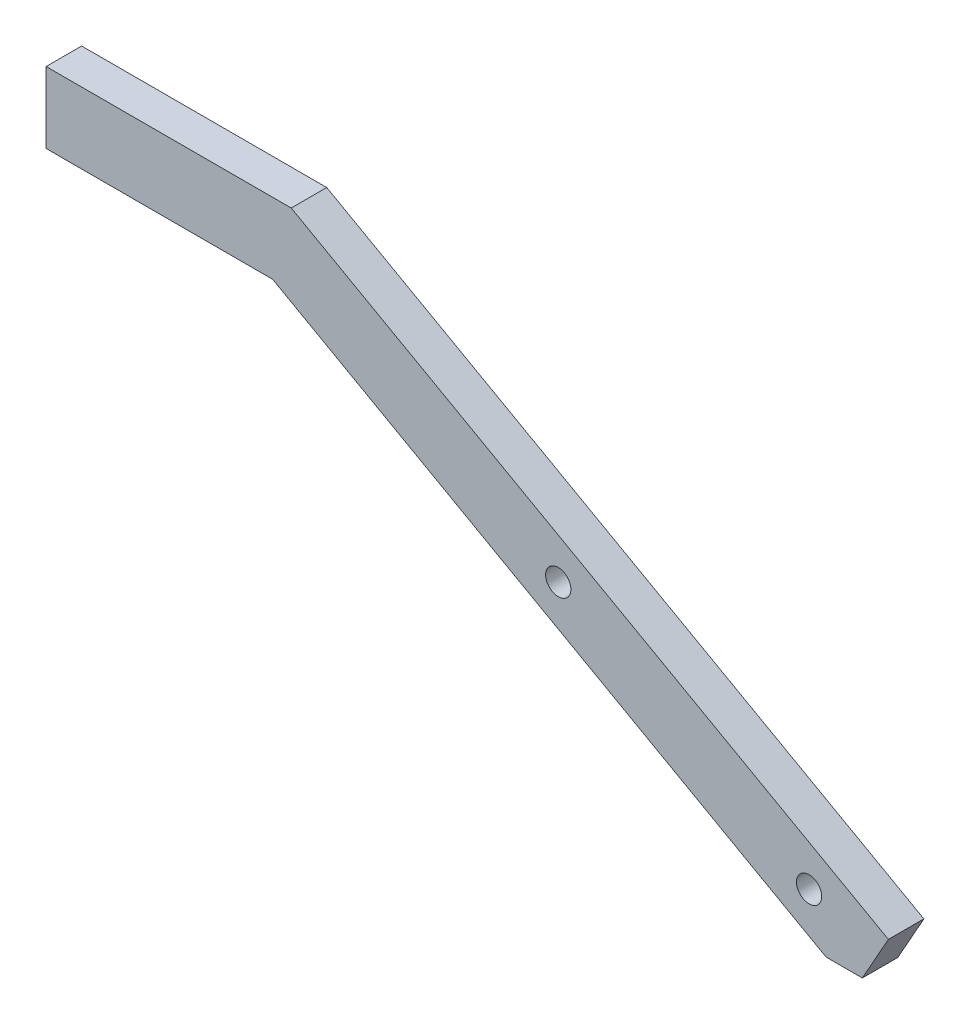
ISO-10303-21;
HEADER;
FILE_DESCRIPTION(('STEP AP214'),'2;1');
FILE_NAME('part.step','',(''),(''),'','','');
FILE_SCHEMA(('AUTOMOTIVE_DESIGN { 1 0 10303 214 1 1 1 1 }'));
ENDSEC;
DATA;
#1=APPLICATION_CONTEXT('core data for automotive mechanical design processes');
#2=APPLICATION_PROTOCOL_DEFINITION('international standard','automotive_design',2000,#1);
#3=PRODUCT_CONTEXT('',#1,'mechanical');
#4=PRODUCT('Part','Part','',(#3));
#5=PRODUCT_RELATED_PRODUCT_CATEGORY('part','',(#4));
#6=PRODUCT_DEFINITION_FORMATION('','',#4);
#7=PRODUCT_DEFINITION_CONTEXT('part definition',#1,'design');
#8=PRODUCT_DEFINITION('design','',#6,#7);
#9=PRODUCT_DEFINITION_SHAPE('','',#8);
#10=(LENGTH_UNIT() NAMED_UNIT(*) SI_UNIT(.MILLI.,.METRE.));
#11=(NAMED_UNIT(*) PLANE_ANGLE_UNIT() SI_UNIT($,.RADIAN.));
#12=(NAMED_UNIT(*) SI_UNIT($,.STERADIAN.) SOLID_ANGLE_UNIT());
#13=UNCERTAINTY_MEASURE_WITH_UNIT(LENGTH_MEASURE(1.E-05),#10,'distance_accuracy_value','');
#14=(GEOMETRIC_REPRESENTATION_CONTEXT(3) GLOBAL_UNCERTAINTY_ASSIGNED_CONTEXT((#13)) GLOBAL_UNIT_ASSIGNED_CONTEXT((#10,
#11,#12)) REPRESENTATION_CONTEXT('',''));
#15=CARTESIAN_POINT('',(0.,0.,0.));
#16=DIRECTION('',(0.,0.,1.));
#17=DIRECTION('',(1.,0.,0.));
#18=AXIS2_PLACEMENT_3D('',#15,#16,#17);
#19=CARTESIAN_POINT('',(-88.2195748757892,-59.4901280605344,0.));
#20=DIRECTION('',(0.,0.,1.));
#21=DIRECTION('',(1.,0.,0.));
#22=AXIS2_PLACEMENT_3D('',#19,#20,#21);
#23=PLANE('',#22);
#24=CARTESIAN_POINT('',(-20.,-55.,0.));
#25=DIRECTION('',(0.,0.,-1.));
#26=DIRECTION('',(-1.,0.,0.));
#27=AXIS2_PLACEMENT_3D('',#24,#25,#26);
#28=CIRCLE('',#27,1.13029999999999);
#29=CARTESIAN_POINT('',(-21.1303,-55.,0.));
#30=VERTEX_POINT('',#29);
#31=EDGE_CURVE('E201',#30,#30,#28,.T.);
#32=ORIENTED_EDGE('',*,*,#31,.F.);
#33=EDGE_LOOP('',(#32));
#34=FACE_BOUND('',#33,.T.);
#35=DIRECTION('',(1.,0.,0.));
#36=VECTOR('',#35,1.);
#37=CARTESIAN_POINT('',(-15.2375,-59.4901280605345,0.));
#38=LINE('',#37,#36);
#39=CARTESIAN_POINT('',(-18.4836446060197,-59.4901280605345,0.));
#40=VERTEX_POINT('',#39);
#41=CARTESIAN_POINT('',(-15.2375,-59.4901280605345,0.));
#42=VERTEX_POINT('',#41);
#43=EDGE_CURVE('E98',#40,#42,#38,.T.);
#44=ORIENTED_EDGE('',*,*,#43,.F.);
#45=DIRECTION('',(0.872260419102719,-0.489041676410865,0.));
#46=VECTOR('',#45,1.);
#47=CARTESIAN_POINT('',(-18.4836446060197,-59.4901280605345,0.));
#48=LINE('',#47,#46);
#49=CARTESIAN_POINT('',(-67.9612594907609,-31.75,0.));
#50=VERTEX_POINT('',#49);
#51=EDGE_CURVE('E126',#50,#40,#48,.T.);
#52=ORIENTED_EDGE('',*,*,#51,.F.);
#53=DIRECTION('',(1.,0.,0.));
#54=VECTOR('',#53,1.);
#55=CARTESIAN_POINT('',(-67.9612594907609,-31.75,0.));
#56=LINE('',#55,#54);
#57=CARTESIAN_POINT('',(-88.2195748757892,-31.75,0.));
#58=VERTEX_POINT('',#57);
#59=EDGE_CURVE('E124',#58,#50,#56,.T.);
#60=ORIENTED_EDGE('',*,*,#59,.F.);
#61=DIRECTION('',(0.,-1.,0.));
#62=VECTOR('',#61,1.);
#63=CARTESIAN_POINT('',(-88.2195748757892,-25.4,0.));
#64=LINE('',#63,#62);
#65=CARTESIAN_POINT('',(-88.2195748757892,-25.4,0.));
#66=VERTEX_POINT('',#65);
#67=EDGE_CURVE('E122',#66,#58,#64,.T.);
#68=ORIENTED_EDGE('',*,*,#67,.F.);
#69=DIRECTION('',(-1.,0.,0.));
#70=VECTOR('',#69,1.);
#71=CARTESIAN_POINT('',(-66.3026148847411,-25.4,0.));
#72=LINE('',#71,#70);
#73=CARTESIAN_POINT('',(-66.3026148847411,-25.4,0.));
#74=VERTEX_POINT('',#73);
#75=EDGE_CURVE('E120',#74,#66,#72,.T.);
#76=ORIENTED_EDGE('',*,*,#75,.F.);
#77=DIRECTION('',(-0.872260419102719,0.489041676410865,0.));
#78=VECTOR('',#77,1.);
#79=CARTESIAN_POINT('',(-12.9084390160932,-55.3359878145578,0.));
#80=LINE('',#79,#78);
#81=CARTESIAN_POINT('',(-12.9084390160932,-55.3359878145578,0.));
#82=VERTEX_POINT('',#81);
#83=EDGE_CURVE('E100',#82,#74,#80,.T.);
#84=ORIENTED_EDGE('',*,*,#83,.F.);
#85=DIRECTION('',(0.489041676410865,0.872260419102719,0.));
#86=VECTOR('',#85,1.);
#87=CARTESIAN_POINT('',(-12.9084390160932,-55.3359878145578,0.));
#88=LINE('',#87,#86);
#89=EDGE_CURVE('E94',#42,#82,#88,.T.);
#90=ORIENTED_EDGE('',*,*,#89,.F.);
#91=EDGE_LOOP('',(#44,#52,#60,#68,#76,#84,#90));
#92=FACE_BOUND('',#91,.T.);
#93=CARTESIAN_POINT('',(-42.4264068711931,-42.4264068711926,0.));
#94=DIRECTION('',(0.,0.,-1.));
#95=DIRECTION('',(-1.,0.,0.));
#96=AXIS2_PLACEMENT_3D('',#93,#94,#95);
#97=CIRCLE('',#96,1.13029999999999);
#98=CARTESIAN_POINT('',(-43.5567068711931,-42.4264068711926,0.));
#99=VERTEX_POINT('',#98);
#100=EDGE_CURVE('E115',#99,#99,#97,.T.);
#101=ORIENTED_EDGE('',*,*,#100,.F.);
#102=EDGE_LOOP('',(#101));
#103=FACE_BOUND('',#102,.T.);
#104=ADVANCED_FACE('F35',(#34,#92,#103),#23,.F.);
#105=CARTESIAN_POINT('',(-15.2375,-59.4901280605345,3.175));
#106=DIRECTION('',(0.,1.,0.));
#107=DIRECTION('',(-1.,0.,0.));
#108=AXIS2_PLACEMENT_3D('',#105,#106,#107);
#109=PLANE('',#108);
#110=ORIENTED_EDGE('',*,*,#43,.T.);
#111=DIRECTION('',(0.,0.,-1.));
#112=VECTOR('',#111,1.);
#113=CARTESIAN_POINT('',(-15.2375,-59.4901280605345,3.175));
#114=LINE('',#113,#112);
#115=CARTESIAN_POINT('',(-15.2375,-59.4901280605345,3.175));
#116=VERTEX_POINT('',#115);
#117=EDGE_CURVE('E11',#116,#42,#114,.T.);
#118=ORIENTED_EDGE('',*,*,#117,.F.);
#119=DIRECTION('',(1.,0.,0.));
#120=VECTOR('',#119,1.);
#121=CARTESIAN_POINT('',(-15.2375,-59.4901280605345,3.175));
#122=LINE('',#121,#120);
#123=CARTESIAN_POINT('',(-18.4836446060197,-59.4901280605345,3.175));
#124=VERTEX_POINT('',#123);
#125=EDGE_CURVE('E128',#124,#116,#122,.T.);
#126=ORIENTED_EDGE('',*,*,#125,.F.);
#127=DIRECTION('',(0.,0.,-1.));
#128=VECTOR('',#127,1.);
#129=CARTESIAN_POINT('',(-18.4836446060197,-59.4901280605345,3.175));
#130=LINE('',#129,#128);
#131=EDGE_CURVE('E111',#124,#40,#130,.T.);
#132=ORIENTED_EDGE('',*,*,#131,.T.);
#133=EDGE_LOOP('',(#110,#118,#126,#132));
#134=FACE_BOUND('',#133,.T.);
#135=ADVANCED_FACE('F37',(#134),#109,.F.);
#136=CARTESIAN_POINT('',(-12.9084390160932,-55.3359878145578,3.175));
#137=DIRECTION('',(-0.872260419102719,0.489041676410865,0.));
#138=DIRECTION('',(-0.489041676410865,-0.872260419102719,0.));
#139=AXIS2_PLACEMENT_3D('',#136,#137,#138);
#140=PLANE('',#139);
#141=ORIENTED_EDGE('',*,*,#89,.T.);
#142=DIRECTION('',(0.,0.,-1.));
#143=VECTOR('',#142,1.);
#144=CARTESIAN_POINT('',(-12.9084390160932,-55.3359878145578,3.175));
#145=LINE('',#144,#143);
#146=CARTESIAN_POINT('',(-12.9084390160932,-55.3359878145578,3.175));
#147=VERTEX_POINT('',#146);
#148=EDGE_CURVE('E43',#147,#82,#145,.T.);
#149=ORIENTED_EDGE('',*,*,#148,.F.);
#150=DIRECTION('',(0.489041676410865,0.872260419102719,0.));
#151=VECTOR('',#150,1.);
#152=CARTESIAN_POINT('',(-12.9084390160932,-55.3359878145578,3.175));
#153=LINE('',#152,#151);
#154=EDGE_CURVE('E107',#116,#147,#153,.T.);
#155=ORIENTED_EDGE('',*,*,#154,.F.);
#156=ORIENTED_EDGE('',*,*,#117,.T.);
#157=EDGE_LOOP('',(#141,#149,#155,#156));
#158=FACE_BOUND('',#157,.T.);
#159=ADVANCED_FACE('F106',(#158),#140,.F.);
#160=CARTESIAN_POINT('',(-12.9084390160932,-55.3359878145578,3.175));
#161=DIRECTION('',(-0.489041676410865,-0.872260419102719,0.));
#162=DIRECTION('',(0.872260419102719,-0.489041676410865,0.));
#163=AXIS2_PLACEMENT_3D('',#160,#161,#162);
#164=PLANE('',#163);
#165=ORIENTED_EDGE('',*,*,#83,.T.);
#166=DIRECTION('',(0.,0.,-1.));
#167=VECTOR('',#166,1.);
#168=CARTESIAN_POINT('',(-66.3026148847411,-25.4,3.175));
#169=LINE('',#168,#167);
#170=CARTESIAN_POINT('',(-66.3026148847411,-25.4,3.175));
#171=VERTEX_POINT('',#170);
#172=EDGE_CURVE('E149',#171,#74,#169,.T.);
#173=ORIENTED_EDGE('',*,*,#172,.F.);
#174=DIRECTION('',(-0.872260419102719,0.489041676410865,0.));
#175=VECTOR('',#174,1.);
#176=CARTESIAN_POINT('',(-12.9084390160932,-55.3359878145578,3.175));
#177=LINE('',#176,#175);
#178=EDGE_CURVE('E131',#147,#171,#177,.T.);
#179=ORIENTED_EDGE('',*,*,#178,.F.);
#180=ORIENTED_EDGE('',*,*,#148,.T.);
#181=EDGE_LOOP('',(#165,#173,#179,#180));
#182=FACE_BOUND('',#181,.T.);
#183=ADVANCED_FACE('F153',(#182),#164,.F.);
#184=CARTESIAN_POINT('',(-66.3026148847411,-25.4,3.175));
#185=DIRECTION('',(0.,-1.,0.));
#186=DIRECTION('',(1.,0.,0.));
#187=AXIS2_PLACEMENT_3D('',#184,#185,#186);
#188=PLANE('',#187);
#189=ORIENTED_EDGE('',*,*,#75,.T.);
#190=DIRECTION('',(0.,0.,-1.));
#191=VECTOR('',#190,1.);
#192=CARTESIAN_POINT('',(-88.2195748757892,-25.4,3.175));
#193=LINE('',#192,#191);
#194=CARTESIAN_POINT('',(-88.2195748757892,-25.4,3.175));
#195=VERTEX_POINT('',#194);
#196=EDGE_CURVE('E146',#195,#66,#193,.T.);
#197=ORIENTED_EDGE('',*,*,#196,.F.);
#198=DIRECTION('',(-1.,0.,0.));
#199=VECTOR('',#198,1.);
#200=CARTESIAN_POINT('',(-66.3026148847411,-25.4,3.175));
#201=LINE('',#200,#199);
#202=EDGE_CURVE('E133',#171,#195,#201,.T.);
#203=ORIENTED_EDGE('',*,*,#202,.F.);
#204=ORIENTED_EDGE('',*,*,#172,.T.);
#205=EDGE_LOOP('',(#189,#197,#203,#204));
#206=FACE_BOUND('',#205,.T.);
#207=ADVANCED_FACE('F161',(#206),#188,.F.);
#208=CARTESIAN_POINT('',(-88.2195748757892,-25.4,3.175));
#209=DIRECTION('',(1.,0.,0.));
#210=DIRECTION('',(0.,0.,-1.));
#211=AXIS2_PLACEMENT_3D('',#208,#209,#210);
#212=PLANE('',#211);
#213=ORIENTED_EDGE('',*,*,#67,.T.);
#214=DIRECTION('',(0.,0.,-1.));
#215=VECTOR('',#214,1.);
#216=CARTESIAN_POINT('',(-88.2195748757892,-31.75,3.175));
#217=LINE('',#216,#215);
#218=CARTESIAN_POINT('',(-88.2195748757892,-31.75,3.175));
#219=VERTEX_POINT('',#218);
#220=EDGE_CURVE('E143',#219,#58,#217,.T.);
#221=ORIENTED_EDGE('',*,*,#220,.F.);
#222=DIRECTION('',(0.,-1.,0.));
#223=VECTOR('',#222,1.);
#224=CARTESIAN_POINT('',(-88.2195748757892,-25.4,3.175));
#225=LINE('',#224,#223);
#226=EDGE_CURVE('E135',#195,#219,#225,.T.);
#227=ORIENTED_EDGE('',*,*,#226,.F.);
#228=ORIENTED_EDGE('',*,*,#196,.T.);
#229=EDGE_LOOP('',(#213,#221,#227,#228));
#230=FACE_BOUND('',#229,.T.);
#231=ADVANCED_FACE('F164',(#230),#212,.F.);
#232=CARTESIAN_POINT('',(-67.9612594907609,-31.75,3.175));
#233=DIRECTION('',(0.,1.,0.));
#234=DIRECTION('',(0.,0.,1.));
#235=AXIS2_PLACEMENT_3D('',#232,#233,#234);
#236=PLANE('',#235);
#237=ORIENTED_EDGE('',*,*,#59,.T.);
#238=DIRECTION('',(0.,0.,-1.));
#239=VECTOR('',#238,1.);
#240=CARTESIAN_POINT('',(-67.9612594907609,-31.75,3.175));
#241=LINE('',#240,#239);
#242=CARTESIAN_POINT('',(-67.9612594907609,-31.75,3.175));
#243=VERTEX_POINT('',#242);
#244=EDGE_CURVE('E140',#243,#50,#241,.T.);
#245=ORIENTED_EDGE('',*,*,#244,.F.);
#246=DIRECTION('',(1.,0.,0.));
#247=VECTOR('',#246,1.);
#248=CARTESIAN_POINT('',(-67.9612594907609,-31.75,3.175));
#249=LINE('',#248,#247);
#250=EDGE_CURVE('E55',#219,#243,#249,.T.);
#251=ORIENTED_EDGE('',*,*,#250,.F.);
#252=ORIENTED_EDGE('',*,*,#220,.T.);
#253=EDGE_LOOP('',(#237,#245,#251,#252));
#254=FACE_BOUND('',#253,.T.);
#255=ADVANCED_FACE('F167',(#254),#236,.F.);
#256=CARTESIAN_POINT('',(-18.4836446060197,-59.4901280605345,3.175));
#257=DIRECTION('',(0.489041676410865,0.872260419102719,0.));
#258=DIRECTION('',(-0.872260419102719,0.489041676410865,0.));
#259=AXIS2_PLACEMENT_3D('',#256,#257,#258);
#260=PLANE('',#259);
#261=ORIENTED_EDGE('',*,*,#51,.T.);
#262=ORIENTED_EDGE('',*,*,#131,.F.);
#263=DIRECTION('',(0.872260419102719,-0.489041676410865,0.));
#264=VECTOR('',#263,1.);
#265=CARTESIAN_POINT('',(-18.4836446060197,-59.4901280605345,3.175));
#266=LINE('',#265,#264);
#267=EDGE_CURVE('E50',#243,#124,#266,.T.);
#268=ORIENTED_EDGE('',*,*,#267,.F.);
#269=ORIENTED_EDGE('',*,*,#244,.T.);
#270=EDGE_LOOP('',(#261,#262,#268,#269));
#271=FACE_BOUND('',#270,.T.);
#272=ADVANCED_FACE('F169',(#271),#260,.F.);
#273=CARTESIAN_POINT('',(-88.2195748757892,-59.4901280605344,3.175));
#274=DIRECTION('',(0.,0.,1.));
#275=DIRECTION('',(1.,0.,0.));
#276=AXIS2_PLACEMENT_3D('',#273,#274,#275);
#277=PLANE('',#276);
#278=CARTESIAN_POINT('',(-20.,-55.,3.175));
#279=DIRECTION('',(0.,0.,-1.));
#280=DIRECTION('',(-1.,0.,0.));
#281=AXIS2_PLACEMENT_3D('',#278,#279,#280);
#282=CIRCLE('',#281,1.1303);
#283=CARTESIAN_POINT('',(-21.1303,-55.,3.175));
#284=VERTEX_POINT('',#283);
#285=EDGE_CURVE('E199',#284,#284,#282,.T.);
#286=ORIENTED_EDGE('',*,*,#285,.T.);
#287=EDGE_LOOP('',(#286));
#288=FACE_BOUND('',#287,.T.);
#289=CARTESIAN_POINT('',(-42.4264068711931,-42.4264068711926,3.175));
#290=DIRECTION('',(0.,0.,-1.));
#291=DIRECTION('',(-1.,0.,0.));
#292=AXIS2_PLACEMENT_3D('',#289,#290,#291);
#293=CIRCLE('',#292,1.1303);
#294=CARTESIAN_POINT('',(-43.5567068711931,-42.4264068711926,3.175));
#295=VERTEX_POINT('',#294);
#296=EDGE_CURVE('E112',#295,#295,#293,.T.);
#297=ORIENTED_EDGE('',*,*,#296,.T.);
#298=EDGE_LOOP('',(#297));
#299=FACE_BOUND('',#298,.T.);
#300=ORIENTED_EDGE('',*,*,#125,.T.);
#301=ORIENTED_EDGE('',*,*,#154,.T.);
#302=ORIENTED_EDGE('',*,*,#178,.T.);
#303=ORIENTED_EDGE('',*,*,#202,.T.);
#304=ORIENTED_EDGE('',*,*,#226,.T.);
#305=ORIENTED_EDGE('',*,*,#250,.T.);
#306=ORIENTED_EDGE('',*,*,#267,.T.);
#307=EDGE_LOOP('',(#300,#301,#302,#303,#304,#305,#306));
#308=FACE_BOUND('',#307,.T.);
#309=ADVANCED_FACE('F156',(#288,#299,#308),#277,.T.);
#310=CARTESIAN_POINT('',(-42.4264068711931,-42.4264068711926,0.));
#311=DIRECTION('',(0.,0.,-1.));
#312=DIRECTION('',(-1.,0.,0.));
#313=AXIS2_PLACEMENT_3D('',#310,#311,#312);
#314=CYLINDRICAL_SURFACE('',#313,1.13029999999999);
#315=ORIENTED_EDGE('',*,*,#296,.F.);
#316=EDGE_LOOP('',(#315));
#317=FACE_BOUND('',#316,.T.);
#318=ORIENTED_EDGE('',*,*,#100,.T.);
#319=EDGE_LOOP('',(#318));
#320=FACE_BOUND('',#319,.T.);
#321=ADVANCED_FACE('F176',(#317,#320),#314,.F.);
#322=CARTESIAN_POINT('',(-20.,-55.,0.));
#323=DIRECTION('',(0.,0.,-1.));
#324=DIRECTION('',(-1.,0.,0.));
#325=AXIS2_PLACEMENT_3D('',#322,#323,#324);
#326=CYLINDRICAL_SURFACE('',#325,1.13029999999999);
#327=ORIENTED_EDGE('',*,*,#285,.F.);
#328=EDGE_LOOP('',(#327));
#329=FACE_BOUND('',#328,.T.);
#330=ORIENTED_EDGE('',*,*,#31,.T.);
#331=EDGE_LOOP('',(#330));
#332=FACE_BOUND('',#331,.T.);
#333=ADVANCED_FACE('F190',(#329,#332),#326,.F.);
#334=CLOSED_SHELL('',(#104,#135,#159,#183,#207,#231,#255,#272,#309,#321,#333));
#335=MANIFOLD_SOLID_BREP('B2',#334);
#336=ADVANCED_BREP_SHAPE_REPRESENTATION('',(#18,#335),#14);
#337=SHAPE_DEFINITION_REPRESENTATION(#9,#336);
ENDSEC;
END-ISO-10303-21;
